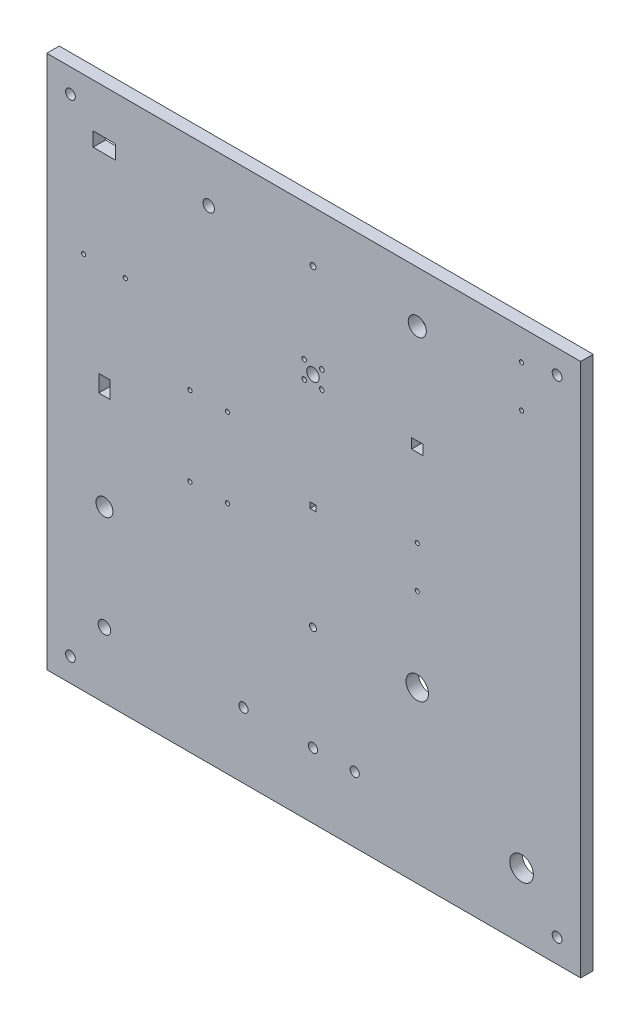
from build123d import *

# Parameters (mm, degrees)
SKETCH1_W            = 384
SKETCH1_H            = 384
SKETCH1_R            = 1.5
SKETCH1_R_2          = 8.5
SKETCH1_R_3          = 4.1
SKETCH1_R_4          = 8.1
SKETCH1_R_5          = 4.5
SKETCH1_R_6          = 6.5
SKETCH1_R_7          = 2.1
SKETCH1_R_8          = 2.5
SKETCH1_R_9          = 6.1
SKETCH1_R_10         = 1.65
SKETCH1_R_11         = 3.3
SKETCH1_W_2          = 8.1374
SKETCH1_H_2          = 12.1778
SKETCH1_W_3          = 4.11
SKETCH1_H_3          = 4.11
BOSS_EXTRUDE1_DEPTH  = 4.4958
M6_CLEARANCE_HOLE2_D = 7
SKETCH6_W            = 80
SKETCH6_H            = 80
CUT_EXTRUDE1_DEPTH   = 0.5


with BuildPart() as part:
    # Sketch1 → Boss-Extrude1 (new, symmetric)
    with BuildSketch(Plane.XY):
        with Locations((0.550386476, -5.175777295)):
            Rectangle(SKETCH1_W, SKETCH1_H)
        with Locations((-88.5, 28.5)):
            Circle(SKETCH1_R, mode=Mode.SUBTRACT)
        with Locations((-88.5, -28.5)):
            Circle(SKETCH1_R, mode=Mode.SUBTRACT)
        with Locations((-61.5, 28.5)):
            Circle(SKETCH1_R, mode=Mode.SUBTRACT)
        with Locations((-61.5, -28.5)):
            Circle(SKETCH1_R, mode=Mode.SUBTRACT)
        with Locations((150, -150)):
            Circle(SKETCH1_R_2, mode=Mode.SUBTRACT)
        with Locations((-75, 150)):
            Circle(SKETCH1_R_3, mode=Mode.SUBTRACT)
        with Locations((75, -75)):
            Circle(SKETCH1_R_4, mode=Mode.SUBTRACT)
        with Locations((-150, -150)):
            Circle(SKETCH1_R_5, mode=Mode.SUBTRACT)
        with Locations((75, 150)):
            Circle(SKETCH1_R_6, mode=Mode.SUBTRACT)
        with Locations((0, 150)):
            Circle(SKETCH1_R_7, mode=Mode.SUBTRACT)
        with Locations((0, -75)):
            Circle(SKETCH1_R_8, mode=Mode.SUBTRACT)
        with Locations((-150, -75)):
            Circle(SKETCH1_R_9, mode=Mode.SUBTRACT)
        with Locations((-165, 75)):
            Circle(SKETCH1_R, mode=Mode.SUBTRACT)
        with Locations((-135, 75)):
            Circle(SKETCH1_R, mode=Mode.SUBTRACT)
        with Locations((150, 165)):
            Circle(SKETCH1_R, mode=Mode.SUBTRACT)
        with Locations((150, 135)):
            Circle(SKETCH1_R, mode=Mode.SUBTRACT)
        with Locations((75, 15)):
            Circle(SKETCH1_R, mode=Mode.SUBTRACT)
        with Locations((75, -15)):
            Circle(SKETCH1_R, mode=Mode.SUBTRACT)
        with Locations((6.3, 88.8)):
            Circle(SKETCH1_R_10, mode=Mode.SUBTRACT)
        with Locations((6.3, 76.2)):
            Circle(SKETCH1_R_10, mode=Mode.SUBTRACT)
        with Locations((-6.3, 76.2)):
            Circle(SKETCH1_R_10, mode=Mode.SUBTRACT)
        with Locations((-6.3, 88.8)):
            Circle(SKETCH1_R_10, mode=Mode.SUBTRACT)
        with Locations((0, 82.5)):
            Circle(SKETCH1_R_5, mode=Mode.SUBTRACT)
        with Locations((-50, -150)):
            Circle(SKETCH1_R_11, mode=Mode.SUBTRACT)
        with Locations((0, -150)):
            Circle(SKETCH1_R_11, mode=Mode.SUBTRACT)
        with Locations((30, -150)):
            Circle(SKETCH1_R_11, mode=Mode.SUBTRACT)
        with Locations((-150, 0)):
            Rectangle(SKETCH1_W_2, SKETCH1_H_2, mode=Mode.SUBTRACT)
        Rectangle(SKETCH1_W_3, SKETCH1_H_3, mode=Mode.SUBTRACT)
        Polygon((79.065880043, 71.425797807), (79.078507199, 78.559786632), (70.934119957, 78.574202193), (70.921492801, 71.440213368), align=None, mode=Mode.SUBTRACT)
        Polygon((-141.908001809, 144.893995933), (-141.873889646, 155.051538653), (-158.091998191, 155.106004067), (-158.126110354, 144.948461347), align=None, mode=Mode.SUBTRACT)
    extrude(amount=BOSS_EXTRUDE1_DEPTH, both=True)

    # M6 Clearance Hole2 (through all)
    with Locations(Plane.XY.offset(4.4958)):
        with Locations((-174.449613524, -180.175777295), (-174.449613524, 169.824222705), (175.550386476, 169.824222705), (175.550386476, -180.175777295)):
            Hole(M6_CLEARANCE_HOLE2_D / 2)

    # Sketch6 → Cut-Extrude1 (cut)
    with BuildSketch(Plane(origin=(0, 0, -4.4958), x_dir=(-1, 0, 0), z_dir=(0, 0, -1))):
        with Locations((-144.550386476, -5.175777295)):
            Rectangle(SKETCH6_W, SKETCH6_H)
    extrude(amount=-CUT_EXTRUDE1_DEPTH, mode=Mode.SUBTRACT)


solid = part.part
